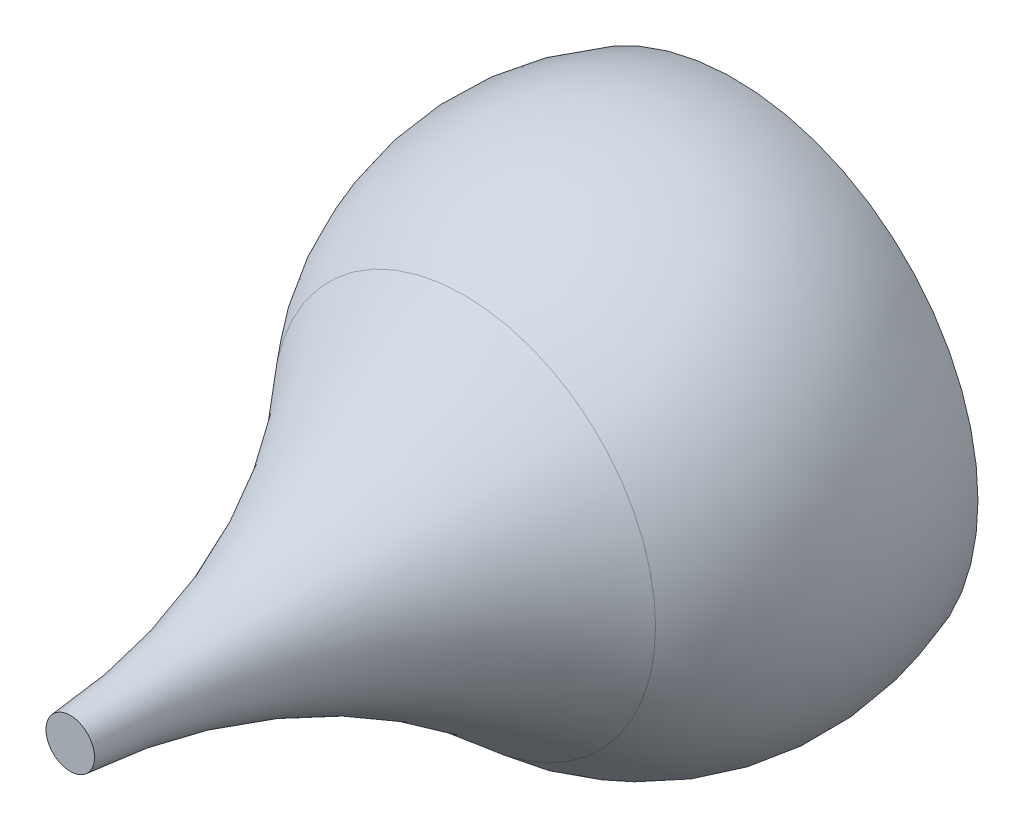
from build123d import *

# Parameters (mm, degrees)
SCHIZZO62_16_W            = 20.75
SCHIZZO62_16_H            = 1.8
CORPO_SPOSTA_COPIA1_ANGLE = 90


with BuildPart() as part:
    # Schizzo62 → Rivoluzione16 (revolve)
    with BuildSketch(Plane.XY, mode=Mode.PRIVATE) as rivoluzione16_sk:
        with BuildLine():
            ThreePointArc((39.37570752, 71.721781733), (42.074652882, 68.580835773), (44.849944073, 65.507139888))
            ThreePointArc((44.849944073, 65.507139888), (59.852459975, 36.330579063), (57.603820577, 3.6))
            Line((57.603820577, 3.6), (20.75, 3.6))
            Line((20.75, 3.6), (20.75, 1.8))
            Line((20.75, 1.8), (0, 1.8))
            Line((0, 1.8), (0, 0))
            Line((0, 0), (62.671150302, 0))
            ThreePointArc((62.671150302, 0), (65.895476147, 36.706663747), (49.253515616, 69.582499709))
            ThreePointArc((49.253515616, 69.582499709), (18.899148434, 116.537609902), (6.249324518, 171))
            Line((6.249324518, 171), (0, 171))
            Line((0, 171), (0, 118.701342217))
            Line((0, 118.701342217), (39.37570752, 71.721781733))
        make_face()
    revolve(rivoluzione16_sk.sketch.rotate(Axis((0, 8.35, 0), (0, 1, 0)), 90), axis=Axis((0, 8.35, 0), (0, 1, 0)))


with BuildPart() as body_2:
    # Schizzo62_16 → Rivoluzione20 (revolve)
    with BuildSketch(Plane.XY):
        with Locations((10.375, 2.7)):
            Rectangle(SCHIZZO62_16_W, SCHIZZO62_16_H)
    revolve(axis=Axis((0, 0, 0), (0, 1, 0)))


with BuildPart() as part_1:
    # Corpo-Sposta_copia1: moved
    add(part.part.rotate(Axis((0, 44.1, 0), (1, 0, 0)), CORPO_SPOSTA_COPIA1_ANGLE))


with BuildPart() as body_2_1:
    # Corpo-Sposta_copia1: moved
    add(body_2.part.rotate(Axis((0, 44.1, 0), (1, 0, 0)), CORPO_SPOSTA_COPIA1_ANGLE))


solid = Compound([part_1.part, body_2_1.part])
